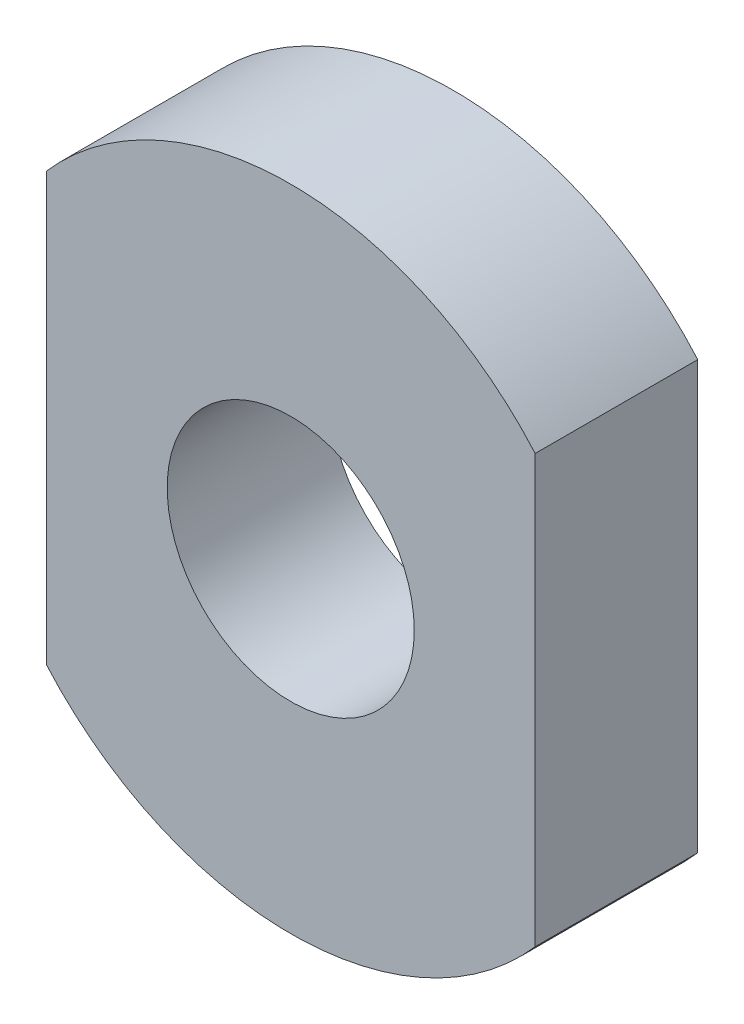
ISO-10303-21;
HEADER;
FILE_DESCRIPTION(('STEP AP214'),'2;1');
FILE_NAME('part.step','',(''),(''),'','','');
FILE_SCHEMA(('AUTOMOTIVE_DESIGN { 1 0 10303 214 1 1 1 1 }'));
ENDSEC;
DATA;
#1=APPLICATION_CONTEXT('core data for automotive mechanical design processes');
#2=APPLICATION_PROTOCOL_DEFINITION('international standard','automotive_design',2000,#1);
#3=PRODUCT_CONTEXT('',#1,'mechanical');
#4=PRODUCT('Part','Part','',(#3));
#5=PRODUCT_RELATED_PRODUCT_CATEGORY('part','',(#4));
#6=PRODUCT_DEFINITION_FORMATION('','',#4);
#7=PRODUCT_DEFINITION_CONTEXT('part definition',#1,'design');
#8=PRODUCT_DEFINITION('design','',#6,#7);
#9=PRODUCT_DEFINITION_SHAPE('','',#8);
#10=(LENGTH_UNIT() NAMED_UNIT(*) SI_UNIT(.MILLI.,.METRE.));
#11=(NAMED_UNIT(*) PLANE_ANGLE_UNIT() SI_UNIT($,.RADIAN.));
#12=(NAMED_UNIT(*) SI_UNIT($,.STERADIAN.) SOLID_ANGLE_UNIT());
#13=UNCERTAINTY_MEASURE_WITH_UNIT(LENGTH_MEASURE(1.E-05),#10,'distance_accuracy_value','');
#14=(GEOMETRIC_REPRESENTATION_CONTEXT(3) GLOBAL_UNCERTAINTY_ASSIGNED_CONTEXT((#13)) GLOBAL_UNIT_ASSIGNED_CONTEXT((#10,
#11,#12)) REPRESENTATION_CONTEXT('',''));
#15=CARTESIAN_POINT('',(0.,0.,0.));
#16=DIRECTION('',(0.,0.,1.));
#17=DIRECTION('',(1.,0.,0.));
#18=AXIS2_PLACEMENT_3D('',#15,#16,#17);
#19=CARTESIAN_POINT('',(0.,0.,3.175));
#20=DIRECTION('',(0.,0.,1.));
#21=DIRECTION('',(1.,0.,0.));
#22=AXIS2_PLACEMENT_3D('',#19,#20,#21);
#23=PLANE('',#22);
#24=CARTESIAN_POINT('',(0.,0.,3.175));
#25=DIRECTION('',(0.,0.,1.));
#26=DIRECTION('',(1.,0.,0.));
#27=AXIS2_PLACEMENT_3D('',#24,#25,#26);
#28=CIRCLE('',#27,6.34088177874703);
#29=CARTESIAN_POINT('',(4.7752,4.17183972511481,3.175));
#30=VERTEX_POINT('',#29);
#31=CARTESIAN_POINT('',(-4.7752,4.17183972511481,3.175));
#32=VERTEX_POINT('',#31);
#33=EDGE_CURVE('E84',#30,#32,#28,.T.);
#34=ORIENTED_EDGE('',*,*,#33,.T.);
#35=DIRECTION('',(0.,-1.,0.));
#36=VECTOR('',#35,1.);
#37=CARTESIAN_POINT('',(-4.7752,4.17183972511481,3.175));
#38=LINE('',#37,#36);
#39=CARTESIAN_POINT('',(-4.7752,-4.17183972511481,3.175));
#40=VERTEX_POINT('',#39);
#41=EDGE_CURVE('E79',#32,#40,#38,.T.);
#42=ORIENTED_EDGE('',*,*,#41,.T.);
#43=CARTESIAN_POINT('',(0.,0.,3.175));
#44=DIRECTION('',(0.,0.,1.));
#45=DIRECTION('',(1.,0.,0.));
#46=AXIS2_PLACEMENT_3D('',#43,#44,#45);
#47=CIRCLE('',#46,6.34088177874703);
#48=CARTESIAN_POINT('',(4.7752,-4.17183972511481,3.175));
#49=VERTEX_POINT('',#48);
#50=EDGE_CURVE('E82',#40,#49,#47,.T.);
#51=ORIENTED_EDGE('',*,*,#50,.T.);
#52=DIRECTION('',(0.,1.,0.));
#53=VECTOR('',#52,1.);
#54=CARTESIAN_POINT('',(4.7752,4.17183972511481,3.175));
#55=LINE('',#54,#53);
#56=EDGE_CURVE('E49',#49,#30,#55,.T.);
#57=ORIENTED_EDGE('',*,*,#56,.T.);
#58=EDGE_LOOP('',(#34,#42,#51,#57));
#59=FACE_BOUND('',#58,.T.);
#60=CARTESIAN_POINT('',(0.,0.,3.175));
#61=DIRECTION('',(0.,0.,1.));
#62=DIRECTION('',(1.,0.,0.));
#63=AXIS2_PLACEMENT_3D('',#60,#61,#62);
#64=CIRCLE('',#63,2.413);
#65=CARTESIAN_POINT('',(2.413,0.,3.175));
#66=VERTEX_POINT('',#65);
#67=EDGE_CURVE('E99',#66,#66,#64,.T.);
#68=ORIENTED_EDGE('',*,*,#67,.F.);
#69=EDGE_LOOP('',(#68));
#70=FACE_BOUND('',#69,.T.);
#71=ADVANCED_FACE('F32',(#59,#70),#23,.T.);
#72=CARTESIAN_POINT('',(0.,0.,0.));
#73=DIRECTION('',(0.,0.,1.));
#74=DIRECTION('',(1.,0.,0.));
#75=AXIS2_PLACEMENT_3D('',#72,#73,#74);
#76=PLANE('',#75);
#77=CARTESIAN_POINT('',(0.,0.,0.));
#78=DIRECTION('',(0.,0.,1.));
#79=DIRECTION('',(1.,0.,0.));
#80=AXIS2_PLACEMENT_3D('',#77,#78,#79);
#81=CIRCLE('',#80,6.34088177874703);
#82=CARTESIAN_POINT('',(4.7752,4.17183972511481,0.));
#83=VERTEX_POINT('',#82);
#84=CARTESIAN_POINT('',(-4.7752,4.17183972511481,0.));
#85=VERTEX_POINT('',#84);
#86=EDGE_CURVE('E96',#83,#85,#81,.T.);
#87=ORIENTED_EDGE('',*,*,#86,.F.);
#88=DIRECTION('',(0.,1.,0.));
#89=VECTOR('',#88,1.);
#90=CARTESIAN_POINT('',(4.7752,4.17183972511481,0.));
#91=LINE('',#90,#89);
#92=CARTESIAN_POINT('',(4.7752,-4.17183972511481,0.));
#93=VERTEX_POINT('',#92);
#94=EDGE_CURVE('E72',#93,#83,#91,.T.);
#95=ORIENTED_EDGE('',*,*,#94,.F.);
#96=CARTESIAN_POINT('',(0.,0.,0.));
#97=DIRECTION('',(0.,0.,1.));
#98=DIRECTION('',(1.,0.,0.));
#99=AXIS2_PLACEMENT_3D('',#96,#97,#98);
#100=CIRCLE('',#99,6.34088177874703);
#101=CARTESIAN_POINT('',(-4.7752,-4.17183972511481,0.));
#102=VERTEX_POINT('',#101);
#103=EDGE_CURVE('E66',#102,#93,#100,.T.);
#104=ORIENTED_EDGE('',*,*,#103,.F.);
#105=DIRECTION('',(0.,-1.,0.));
#106=VECTOR('',#105,1.);
#107=CARTESIAN_POINT('',(-4.7752,4.17183972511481,0.));
#108=LINE('',#107,#106);
#109=EDGE_CURVE('E88',#85,#102,#108,.T.);
#110=ORIENTED_EDGE('',*,*,#109,.F.);
#111=EDGE_LOOP('',(#87,#95,#104,#110));
#112=FACE_BOUND('',#111,.T.);
#113=CARTESIAN_POINT('',(0.,0.,0.));
#114=DIRECTION('',(0.,0.,1.));
#115=DIRECTION('',(1.,0.,0.));
#116=AXIS2_PLACEMENT_3D('',#113,#114,#115);
#117=CIRCLE('',#116,2.413);
#118=CARTESIAN_POINT('',(2.413,0.,0.));
#119=VERTEX_POINT('',#118);
#120=EDGE_CURVE('E111',#119,#119,#117,.T.);
#121=ORIENTED_EDGE('',*,*,#120,.T.);
#122=EDGE_LOOP('',(#121));
#123=FACE_BOUND('',#122,.T.);
#124=ADVANCED_FACE('F107',(#112,#123),#76,.F.);
#125=CARTESIAN_POINT('',(0.,0.,3.175));
#126=DIRECTION('',(0.,0.,-1.));
#127=DIRECTION('',(-1.,0.,0.));
#128=AXIS2_PLACEMENT_3D('',#125,#126,#127);
#129=CYLINDRICAL_SURFACE('',#128,6.34088177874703);
#130=ORIENTED_EDGE('',*,*,#86,.T.);
#131=DIRECTION('',(0.,0.,-1.));
#132=VECTOR('',#131,1.);
#133=CARTESIAN_POINT('',(-4.7752,4.17183972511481,3.175));
#134=LINE('',#133,#132);
#135=EDGE_CURVE('E11',#32,#85,#134,.T.);
#136=ORIENTED_EDGE('',*,*,#135,.F.);
#137=ORIENTED_EDGE('',*,*,#33,.F.);
#138=DIRECTION('',(0.,0.,-1.));
#139=VECTOR('',#138,1.);
#140=CARTESIAN_POINT('',(4.7752,4.17183972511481,3.175));
#141=LINE('',#140,#139);
#142=EDGE_CURVE('E92',#30,#83,#141,.T.);
#143=ORIENTED_EDGE('',*,*,#142,.T.);
#144=EDGE_LOOP('',(#130,#136,#137,#143));
#145=FACE_BOUND('',#144,.T.);
#146=ADVANCED_FACE('F34',(#145),#129,.T.);
#147=CARTESIAN_POINT('',(-4.7752,4.17183972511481,3.175));
#148=DIRECTION('',(1.,0.,0.));
#149=DIRECTION('',(0.,0.,-1.));
#150=AXIS2_PLACEMENT_3D('',#147,#148,#149);
#151=PLANE('',#150);
#152=ORIENTED_EDGE('',*,*,#109,.T.);
#153=DIRECTION('',(0.,0.,-1.));
#154=VECTOR('',#153,1.);
#155=CARTESIAN_POINT('',(-4.7752,-4.17183972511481,3.175));
#156=LINE('',#155,#154);
#157=EDGE_CURVE('E41',#40,#102,#156,.T.);
#158=ORIENTED_EDGE('',*,*,#157,.F.);
#159=ORIENTED_EDGE('',*,*,#41,.F.);
#160=ORIENTED_EDGE('',*,*,#135,.T.);
#161=EDGE_LOOP('',(#152,#158,#159,#160));
#162=FACE_BOUND('',#161,.T.);
#163=ADVANCED_FACE('F87',(#162),#151,.F.);
#164=CARTESIAN_POINT('',(0.,0.,3.175));
#165=DIRECTION('',(0.,0.,-1.));
#166=DIRECTION('',(-1.,0.,0.));
#167=AXIS2_PLACEMENT_3D('',#164,#165,#166);
#168=CYLINDRICAL_SURFACE('',#167,6.34088177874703);
#169=ORIENTED_EDGE('',*,*,#103,.T.);
#170=DIRECTION('',(0.,0.,-1.));
#171=VECTOR('',#170,1.);
#172=CARTESIAN_POINT('',(4.7752,-4.17183972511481,3.175));
#173=LINE('',#172,#171);
#174=EDGE_CURVE('E89',#49,#93,#173,.T.);
#175=ORIENTED_EDGE('',*,*,#174,.F.);
#176=ORIENTED_EDGE('',*,*,#50,.F.);
#177=ORIENTED_EDGE('',*,*,#157,.T.);
#178=EDGE_LOOP('',(#169,#175,#176,#177));
#179=FACE_BOUND('',#178,.T.);
#180=ADVANCED_FACE('F90',(#179),#168,.T.);
#181=CARTESIAN_POINT('',(4.7752,4.17183972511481,3.175));
#182=DIRECTION('',(-1.,0.,0.));
#183=DIRECTION('',(0.,0.,1.));
#184=AXIS2_PLACEMENT_3D('',#181,#182,#183);
#185=PLANE('',#184);
#186=ORIENTED_EDGE('',*,*,#94,.T.);
#187=ORIENTED_EDGE('',*,*,#142,.F.);
#188=ORIENTED_EDGE('',*,*,#56,.F.);
#189=ORIENTED_EDGE('',*,*,#174,.T.);
#190=EDGE_LOOP('',(#186,#187,#188,#189));
#191=FACE_BOUND('',#190,.T.);
#192=ADVANCED_FACE('F104',(#191),#185,.F.);
#193=CARTESIAN_POINT('',(0.,0.,3.175));
#194=DIRECTION('',(0.,0.,-1.));
#195=DIRECTION('',(-1.,0.,0.));
#196=AXIS2_PLACEMENT_3D('',#193,#194,#195);
#197=CYLINDRICAL_SURFACE('',#196,2.413);
#198=ORIENTED_EDGE('',*,*,#67,.T.);
#199=EDGE_LOOP('',(#198));
#200=FACE_BOUND('',#199,.T.);
#201=ORIENTED_EDGE('',*,*,#120,.F.);
#202=EDGE_LOOP('',(#201));
#203=FACE_BOUND('',#202,.T.);
#204=ADVANCED_FACE('F117',(#200,#203),#197,.F.);
#205=CLOSED_SHELL('',(#71,#124,#146,#163,#180,#192,#204));
#206=MANIFOLD_SOLID_BREP('B2',#205);
#207=ADVANCED_BREP_SHAPE_REPRESENTATION('',(#18,#206),#14);
#208=SHAPE_DEFINITION_REPRESENTATION(#9,#207);
ENDSEC;
END-ISO-10303-21;
